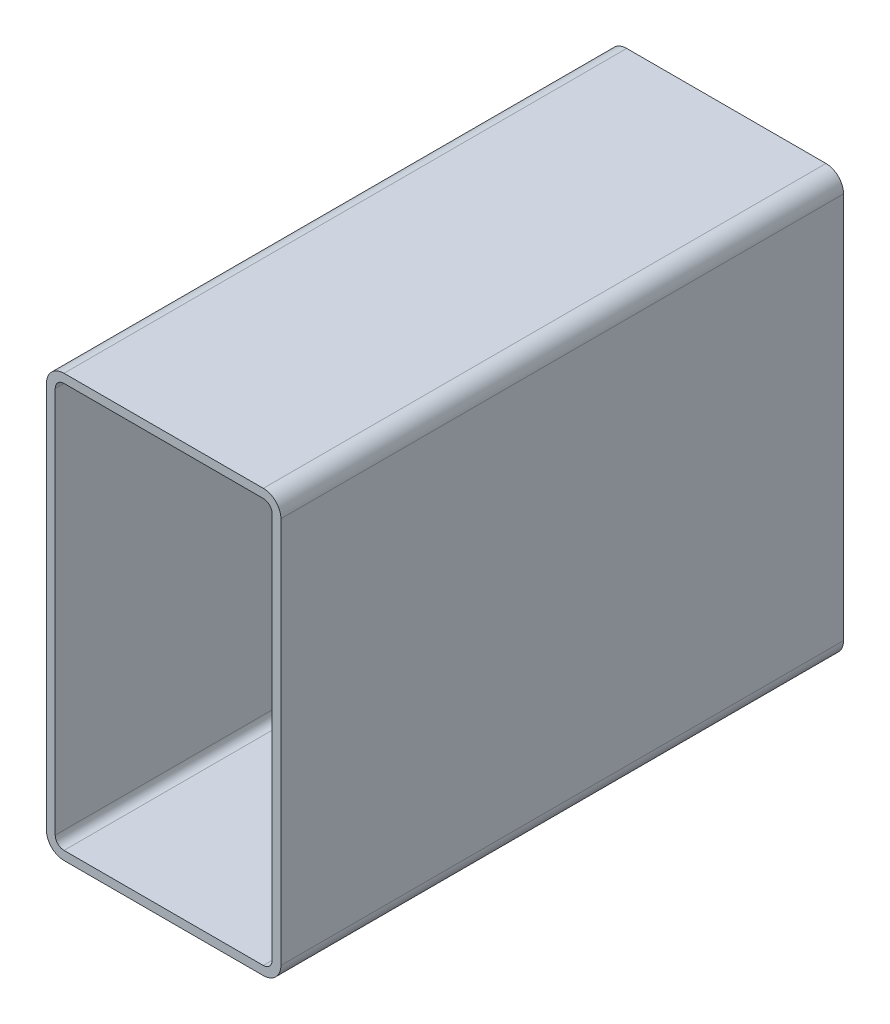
ISO-10303-21;
HEADER;
FILE_DESCRIPTION(('STEP AP214'),'2;1');
FILE_NAME('part.step','',(''),(''),'','','');
FILE_SCHEMA(('AUTOMOTIVE_DESIGN { 1 0 10303 214 1 1 1 1 }'));
ENDSEC;
DATA;
#1=APPLICATION_CONTEXT('core data for automotive mechanical design processes');
#2=APPLICATION_PROTOCOL_DEFINITION('international standard','automotive_design',2000,#1);
#3=PRODUCT_CONTEXT('',#1,'mechanical');
#4=PRODUCT('Part','Part','',(#3));
#5=PRODUCT_RELATED_PRODUCT_CATEGORY('part','',(#4));
#6=PRODUCT_DEFINITION_FORMATION('','',#4);
#7=PRODUCT_DEFINITION_CONTEXT('part definition',#1,'design');
#8=PRODUCT_DEFINITION('design','',#6,#7);
#9=PRODUCT_DEFINITION_SHAPE('','',#8);
#10=(LENGTH_UNIT() NAMED_UNIT(*) SI_UNIT(.MILLI.,.METRE.));
#11=(NAMED_UNIT(*) PLANE_ANGLE_UNIT() SI_UNIT($,.RADIAN.));
#12=(NAMED_UNIT(*) SI_UNIT($,.STERADIAN.) SOLID_ANGLE_UNIT());
#13=UNCERTAINTY_MEASURE_WITH_UNIT(LENGTH_MEASURE(1.E-05),#10,'distance_accuracy_value','');
#14=(GEOMETRIC_REPRESENTATION_CONTEXT(3) GLOBAL_UNCERTAINTY_ASSIGNED_CONTEXT((#13)) GLOBAL_UNIT_ASSIGNED_CONTEXT((#10,
#11,#12)) REPRESENTATION_CONTEXT('',''));
#15=CARTESIAN_POINT('',(0.,0.,0.));
#16=DIRECTION('',(0.,0.,1.));
#17=DIRECTION('',(1.,0.,0.));
#18=AXIS2_PLACEMENT_3D('',#15,#16,#17);
#19=CARTESIAN_POINT('',(10.3862396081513,221.018222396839,304.8));
#20=DIRECTION('',(0.,0.,1.));
#21=DIRECTION('',(1.,0.,0.));
#22=AXIS2_PLACEMENT_3D('',#19,#20,#21);
#23=PLANE('',#22);
#24=CARTESIAN_POINT('',(10.3862396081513,221.018222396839,304.8));
#25=DIRECTION('',(0.,0.,1.));
#26=DIRECTION('',(1.,0.,0.));
#27=AXIS2_PLACEMENT_3D('',#24,#25,#26);
#28=CIRCLE('',#27,9.52500000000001);
#29=CARTESIAN_POINT('',(10.3862396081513,230.543222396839,304.8));
#30=VERTEX_POINT('',#29);
#31=CARTESIAN_POINT('',(0.8612396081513,221.018222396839,304.8));
#32=VERTEX_POINT('',#31);
#33=EDGE_CURVE('E211',#30,#32,#28,.T.);
#34=ORIENTED_EDGE('',*,*,#33,.T.);
#35=DIRECTION('',(0.,-1.,0.));
#36=VECTOR('',#35,1.);
#37=CARTESIAN_POINT('',(0.8612396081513,11.4682223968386,304.8));
#38=LINE('',#37,#36);
#39=CARTESIAN_POINT('',(0.8612396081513,11.4682223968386,304.8));
#40=VERTEX_POINT('',#39);
#41=EDGE_CURVE('E214',#32,#40,#38,.T.);
#42=ORIENTED_EDGE('',*,*,#41,.T.);
#43=CARTESIAN_POINT('',(10.3862396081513,11.4682223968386,304.8));
#44=DIRECTION('',(0.,0.,1.));
#45=DIRECTION('',(1.,0.,0.));
#46=AXIS2_PLACEMENT_3D('',#43,#44,#45);
#47=CIRCLE('',#46,9.525);
#48=CARTESIAN_POINT('',(10.3862396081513,1.94322239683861,304.8));
#49=VERTEX_POINT('',#48);
#50=EDGE_CURVE('E217',#40,#49,#47,.T.);
#51=ORIENTED_EDGE('',*,*,#50,.T.);
#52=DIRECTION('',(1.,0.,0.));
#53=VECTOR('',#52,1.);
#54=CARTESIAN_POINT('',(118.336239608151,1.94322239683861,304.8));
#55=LINE('',#54,#53);
#56=CARTESIAN_POINT('',(118.336239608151,1.94322239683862,304.8));
#57=VERTEX_POINT('',#56);
#58=EDGE_CURVE('E219',#49,#57,#55,.T.);
#59=ORIENTED_EDGE('',*,*,#58,.T.);
#60=CARTESIAN_POINT('',(118.336239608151,11.4682223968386,304.8));
#61=DIRECTION('',(0.,0.,1.));
#62=DIRECTION('',(1.,0.,0.));
#63=AXIS2_PLACEMENT_3D('',#60,#61,#62);
#64=CIRCLE('',#63,9.525);
#65=CARTESIAN_POINT('',(127.861239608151,11.4682223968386,304.8));
#66=VERTEX_POINT('',#65);
#67=EDGE_CURVE('E221',#57,#66,#64,.T.);
#68=ORIENTED_EDGE('',*,*,#67,.T.);
#69=DIRECTION('',(0.,1.,0.));
#70=VECTOR('',#69,1.);
#71=CARTESIAN_POINT('',(127.861239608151,221.018222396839,304.8));
#72=LINE('',#71,#70);
#73=CARTESIAN_POINT('',(127.861239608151,221.018222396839,304.8));
#74=VERTEX_POINT('',#73);
#75=EDGE_CURVE('E223',#66,#74,#72,.T.);
#76=ORIENTED_EDGE('',*,*,#75,.T.);
#77=CARTESIAN_POINT('',(118.336239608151,221.018222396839,304.8));
#78=DIRECTION('',(0.,0.,1.));
#79=DIRECTION('',(1.,0.,0.));
#80=AXIS2_PLACEMENT_3D('',#77,#78,#79);
#81=CIRCLE('',#80,9.525);
#82=CARTESIAN_POINT('',(118.336239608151,230.543222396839,304.8));
#83=VERTEX_POINT('',#82);
#84=EDGE_CURVE('E225',#74,#83,#81,.T.);
#85=ORIENTED_EDGE('',*,*,#84,.T.);
#86=DIRECTION('',(-1.,0.,0.));
#87=VECTOR('',#86,1.);
#88=CARTESIAN_POINT('',(10.3862396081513,230.543222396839,304.8));
#89=LINE('',#88,#87);
#90=EDGE_CURVE('E227',#83,#30,#89,.T.);
#91=ORIENTED_EDGE('',*,*,#90,.T.);
#92=EDGE_LOOP('',(#34,#42,#51,#59,#68,#76,#85,#91));
#93=FACE_BOUND('',#92,.T.);
#94=DIRECTION('',(0.,-1.,0.));
#95=VECTOR('',#94,1.);
#96=CARTESIAN_POINT('',(5.6237396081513,11.4682223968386,304.8));
#97=LINE('',#96,#95);
#98=CARTESIAN_POINT('',(5.6237396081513,221.018222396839,304.8));
#99=VERTEX_POINT('',#98);
#100=CARTESIAN_POINT('',(5.6237396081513,11.4682223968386,304.8));
#101=VERTEX_POINT('',#100);
#102=EDGE_CURVE('E154',#99,#101,#97,.T.);
#103=ORIENTED_EDGE('',*,*,#102,.F.);
#104=CARTESIAN_POINT('',(10.3862396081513,221.018222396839,304.8));
#105=DIRECTION('',(0.,0.,1.));
#106=DIRECTION('',(1.,0.,0.));
#107=AXIS2_PLACEMENT_3D('',#104,#105,#106);
#108=CIRCLE('',#107,4.7625);
#109=CARTESIAN_POINT('',(10.3862396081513,225.780722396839,304.8));
#110=VERTEX_POINT('',#109);
#111=EDGE_CURVE('E146',#110,#99,#108,.T.);
#112=ORIENTED_EDGE('',*,*,#111,.F.);
#113=DIRECTION('',(-1.,0.,0.));
#114=VECTOR('',#113,1.);
#115=CARTESIAN_POINT('',(10.3862396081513,225.780722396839,304.8));
#116=LINE('',#115,#114);
#117=CARTESIAN_POINT('',(118.336239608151,225.780722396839,304.8));
#118=VERTEX_POINT('',#117);
#119=EDGE_CURVE('E179',#118,#110,#116,.T.);
#120=ORIENTED_EDGE('',*,*,#119,.F.);
#121=CARTESIAN_POINT('',(118.336239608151,221.018222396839,304.8));
#122=DIRECTION('',(0.,0.,1.));
#123=DIRECTION('',(1.,0.,0.));
#124=AXIS2_PLACEMENT_3D('',#121,#122,#123);
#125=CIRCLE('',#124,4.7625);
#126=CARTESIAN_POINT('',(123.098739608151,221.018222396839,304.8));
#127=VERTEX_POINT('',#126);
#128=EDGE_CURVE('E177',#127,#118,#125,.T.);
#129=ORIENTED_EDGE('',*,*,#128,.F.);
#130=DIRECTION('',(0.,1.,0.));
#131=VECTOR('',#130,1.);
#132=CARTESIAN_POINT('',(123.098739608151,221.018222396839,304.8));
#133=LINE('',#132,#131);
#134=CARTESIAN_POINT('',(123.098739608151,11.4682223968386,304.8));
#135=VERTEX_POINT('',#134);
#136=EDGE_CURVE('E175',#135,#127,#133,.T.);
#137=ORIENTED_EDGE('',*,*,#136,.F.);
#138=CARTESIAN_POINT('',(118.336239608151,11.4682223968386,304.8));
#139=DIRECTION('',(0.,0.,1.));
#140=DIRECTION('',(1.,0.,0.));
#141=AXIS2_PLACEMENT_3D('',#138,#139,#140);
#142=CIRCLE('',#141,4.7625);
#143=CARTESIAN_POINT('',(118.336239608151,6.70572239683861,304.8));
#144=VERTEX_POINT('',#143);
#145=EDGE_CURVE('E173',#144,#135,#142,.T.);
#146=ORIENTED_EDGE('',*,*,#145,.F.);
#147=DIRECTION('',(1.,0.,0.));
#148=VECTOR('',#147,1.);
#149=CARTESIAN_POINT('',(118.336239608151,6.70572239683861,304.8));
#150=LINE('',#149,#148);
#151=CARTESIAN_POINT('',(10.3862396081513,6.70572239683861,304.8));
#152=VERTEX_POINT('',#151);
#153=EDGE_CURVE('E169',#152,#144,#150,.T.);
#154=ORIENTED_EDGE('',*,*,#153,.F.);
#155=CARTESIAN_POINT('',(10.3862396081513,11.4682223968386,304.8));
#156=DIRECTION('',(0.,0.,1.));
#157=DIRECTION('',(1.,0.,0.));
#158=AXIS2_PLACEMENT_3D('',#155,#156,#157);
#159=CIRCLE('',#158,4.7625);
#160=EDGE_CURVE('E167',#101,#152,#159,.T.);
#161=ORIENTED_EDGE('',*,*,#160,.F.);
#162=EDGE_LOOP('',(#103,#112,#120,#129,#137,#146,#154,#161));
#163=FACE_BOUND('',#162,.T.);
#164=ADVANCED_FACE('F33',(#93,#163),#23,.T.);
#165=CARTESIAN_POINT('',(10.3862396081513,221.018222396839,0.));
#166=DIRECTION('',(0.,0.,1.));
#167=DIRECTION('',(1.,0.,0.));
#168=AXIS2_PLACEMENT_3D('',#165,#166,#167);
#169=PLANE('',#168);
#170=CARTESIAN_POINT('',(10.3862396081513,221.018222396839,0.));
#171=DIRECTION('',(0.,0.,1.));
#172=DIRECTION('',(1.,0.,0.));
#173=AXIS2_PLACEMENT_3D('',#170,#171,#172);
#174=CIRCLE('',#173,9.52500000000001);
#175=CARTESIAN_POINT('',(10.3862396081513,230.543222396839,0.));
#176=VERTEX_POINT('',#175);
#177=CARTESIAN_POINT('',(0.8612396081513,221.018222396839,0.));
#178=VERTEX_POINT('',#177);
#179=EDGE_CURVE('E162',#176,#178,#174,.T.);
#180=ORIENTED_EDGE('',*,*,#179,.F.);
#181=DIRECTION('',(-1.,0.,0.));
#182=VECTOR('',#181,1.);
#183=CARTESIAN_POINT('',(10.3862396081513,230.543222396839,0.));
#184=LINE('',#183,#182);
#185=CARTESIAN_POINT('',(118.336239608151,230.543222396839,0.));
#186=VERTEX_POINT('',#185);
#187=EDGE_CURVE('E215',#186,#176,#184,.T.);
#188=ORIENTED_EDGE('',*,*,#187,.F.);
#189=CARTESIAN_POINT('',(118.336239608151,221.018222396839,0.));
#190=DIRECTION('',(0.,0.,1.));
#191=DIRECTION('',(1.,0.,0.));
#192=AXIS2_PLACEMENT_3D('',#189,#190,#191);
#193=CIRCLE('',#192,9.525);
#194=CARTESIAN_POINT('',(127.861239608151,221.018222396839,0.));
#195=VERTEX_POINT('',#194);
#196=EDGE_CURVE('E242',#195,#186,#193,.T.);
#197=ORIENTED_EDGE('',*,*,#196,.F.);
#198=DIRECTION('',(0.,1.,0.));
#199=VECTOR('',#198,1.);
#200=CARTESIAN_POINT('',(127.861239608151,221.018222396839,0.));
#201=LINE('',#200,#199);
#202=CARTESIAN_POINT('',(127.861239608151,11.4682223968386,0.));
#203=VERTEX_POINT('',#202);
#204=EDGE_CURVE('E240',#203,#195,#201,.T.);
#205=ORIENTED_EDGE('',*,*,#204,.F.);
#206=CARTESIAN_POINT('',(118.336239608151,11.4682223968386,0.));
#207=DIRECTION('',(0.,0.,1.));
#208=DIRECTION('',(1.,0.,0.));
#209=AXIS2_PLACEMENT_3D('',#206,#207,#208);
#210=CIRCLE('',#209,9.525);
#211=CARTESIAN_POINT('',(118.336239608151,1.94322239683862,0.));
#212=VERTEX_POINT('',#211);
#213=EDGE_CURVE('E238',#212,#203,#210,.T.);
#214=ORIENTED_EDGE('',*,*,#213,.F.);
#215=DIRECTION('',(1.,0.,0.));
#216=VECTOR('',#215,1.);
#217=CARTESIAN_POINT('',(118.336239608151,1.94322239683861,0.));
#218=LINE('',#217,#216);
#219=CARTESIAN_POINT('',(10.3862396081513,1.94322239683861,0.));
#220=VERTEX_POINT('',#219);
#221=EDGE_CURVE('E236',#220,#212,#218,.T.);
#222=ORIENTED_EDGE('',*,*,#221,.F.);
#223=CARTESIAN_POINT('',(10.3862396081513,11.4682223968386,0.));
#224=DIRECTION('',(0.,0.,1.));
#225=DIRECTION('',(1.,0.,0.));
#226=AXIS2_PLACEMENT_3D('',#223,#224,#225);
#227=CIRCLE('',#226,9.525);
#228=CARTESIAN_POINT('',(0.8612396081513,11.4682223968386,0.));
#229=VERTEX_POINT('',#228);
#230=EDGE_CURVE('E234',#229,#220,#227,.T.);
#231=ORIENTED_EDGE('',*,*,#230,.F.);
#232=DIRECTION('',(0.,-1.,0.));
#233=VECTOR('',#232,1.);
#234=CARTESIAN_POINT('',(0.8612396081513,11.4682223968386,0.));
#235=LINE('',#234,#233);
#236=EDGE_CURVE('E232',#178,#229,#235,.T.);
#237=ORIENTED_EDGE('',*,*,#236,.F.);
#238=EDGE_LOOP('',(#180,#188,#197,#205,#214,#222,#231,#237));
#239=FACE_BOUND('',#238,.T.);
#240=CARTESIAN_POINT('',(10.3862396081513,221.018222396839,0.));
#241=DIRECTION('',(0.,0.,1.));
#242=DIRECTION('',(1.,0.,0.));
#243=AXIS2_PLACEMENT_3D('',#240,#241,#242);
#244=CIRCLE('',#243,4.7625);
#245=CARTESIAN_POINT('',(10.3862396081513,225.780722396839,0.));
#246=VERTEX_POINT('',#245);
#247=CARTESIAN_POINT('',(5.6237396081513,221.018222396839,0.));
#248=VERTEX_POINT('',#247);
#249=EDGE_CURVE('E56',#246,#248,#244,.T.);
#250=ORIENTED_EDGE('',*,*,#249,.T.);
#251=DIRECTION('',(0.,-1.,0.));
#252=VECTOR('',#251,1.);
#253=CARTESIAN_POINT('',(5.6237396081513,11.4682223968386,0.));
#254=LINE('',#253,#252);
#255=CARTESIAN_POINT('',(5.6237396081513,11.4682223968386,0.));
#256=VERTEX_POINT('',#255);
#257=EDGE_CURVE('E161',#248,#256,#254,.T.);
#258=ORIENTED_EDGE('',*,*,#257,.T.);
#259=CARTESIAN_POINT('',(10.3862396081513,11.4682223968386,0.));
#260=DIRECTION('',(0.,0.,1.));
#261=DIRECTION('',(1.,0.,0.));
#262=AXIS2_PLACEMENT_3D('',#259,#260,#261);
#263=CIRCLE('',#262,4.7625);
#264=CARTESIAN_POINT('',(10.3862396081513,6.70572239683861,0.));
#265=VERTEX_POINT('',#264);
#266=EDGE_CURVE('E183',#256,#265,#263,.T.);
#267=ORIENTED_EDGE('',*,*,#266,.T.);
#268=DIRECTION('',(1.,0.,0.));
#269=VECTOR('',#268,1.);
#270=CARTESIAN_POINT('',(118.336239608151,6.70572239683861,0.));
#271=LINE('',#270,#269);
#272=CARTESIAN_POINT('',(118.336239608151,6.70572239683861,0.));
#273=VERTEX_POINT('',#272);
#274=EDGE_CURVE('E186',#265,#273,#271,.T.);
#275=ORIENTED_EDGE('',*,*,#274,.T.);
#276=CARTESIAN_POINT('',(118.336239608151,11.4682223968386,0.));
#277=DIRECTION('',(0.,0.,1.));
#278=DIRECTION('',(1.,0.,0.));
#279=AXIS2_PLACEMENT_3D('',#276,#277,#278);
#280=CIRCLE('',#279,4.7625);
#281=CARTESIAN_POINT('',(123.098739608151,11.4682223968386,0.));
#282=VERTEX_POINT('',#281);
#283=EDGE_CURVE('E189',#273,#282,#280,.T.);
#284=ORIENTED_EDGE('',*,*,#283,.T.);
#285=DIRECTION('',(0.,1.,0.));
#286=VECTOR('',#285,1.);
#287=CARTESIAN_POINT('',(123.098739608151,221.018222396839,0.));
#288=LINE('',#287,#286);
#289=CARTESIAN_POINT('',(123.098739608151,221.018222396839,0.));
#290=VERTEX_POINT('',#289);
#291=EDGE_CURVE('E192',#282,#290,#288,.T.);
#292=ORIENTED_EDGE('',*,*,#291,.T.);
#293=CARTESIAN_POINT('',(118.336239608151,221.018222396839,0.));
#294=DIRECTION('',(0.,0.,1.));
#295=DIRECTION('',(1.,0.,0.));
#296=AXIS2_PLACEMENT_3D('',#293,#294,#295);
#297=CIRCLE('',#296,4.7625);
#298=CARTESIAN_POINT('',(118.336239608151,225.780722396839,0.));
#299=VERTEX_POINT('',#298);
#300=EDGE_CURVE('E195',#290,#299,#297,.T.);
#301=ORIENTED_EDGE('',*,*,#300,.T.);
#302=DIRECTION('',(-1.,0.,0.));
#303=VECTOR('',#302,1.);
#304=CARTESIAN_POINT('',(10.3862396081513,225.780722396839,0.));
#305=LINE('',#304,#303);
#306=EDGE_CURVE('E155',#299,#246,#305,.T.);
#307=ORIENTED_EDGE('',*,*,#306,.T.);
#308=EDGE_LOOP('',(#250,#258,#267,#275,#284,#292,#301,#307));
#309=FACE_BOUND('',#308,.T.);
#310=ADVANCED_FACE('F272',(#239,#309),#169,.F.);
#311=CARTESIAN_POINT('',(10.3862396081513,221.018222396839,304.8));
#312=DIRECTION('',(0.,0.,-1.));
#313=DIRECTION('',(-1.,0.,0.));
#314=AXIS2_PLACEMENT_3D('',#311,#312,#313);
#315=CYLINDRICAL_SURFACE('',#314,9.52500000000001);
#316=ORIENTED_EDGE('',*,*,#179,.T.);
#317=DIRECTION('',(0.,0.,-1.));
#318=VECTOR('',#317,1.);
#319=CARTESIAN_POINT('',(0.8612396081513,221.018222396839,304.8));
#320=LINE('',#319,#318);
#321=EDGE_CURVE('E11',#32,#178,#320,.T.);
#322=ORIENTED_EDGE('',*,*,#321,.F.);
#323=ORIENTED_EDGE('',*,*,#33,.F.);
#324=DIRECTION('',(0.,0.,-1.));
#325=VECTOR('',#324,1.);
#326=CARTESIAN_POINT('',(10.3862396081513,230.543222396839,304.8));
#327=LINE('',#326,#325);
#328=EDGE_CURVE('E229',#30,#176,#327,.T.);
#329=ORIENTED_EDGE('',*,*,#328,.T.);
#330=EDGE_LOOP('',(#316,#322,#323,#329));
#331=FACE_BOUND('',#330,.T.);
#332=ADVANCED_FACE('F35',(#331),#315,.T.);
#333=CARTESIAN_POINT('',(0.8612396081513,11.4682223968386,304.8));
#334=DIRECTION('',(1.,0.,0.));
#335=DIRECTION('',(0.,0.,-1.));
#336=AXIS2_PLACEMENT_3D('',#333,#334,#335);
#337=PLANE('',#336);
#338=ORIENTED_EDGE('',*,*,#236,.T.);
#339=DIRECTION('',(0.,0.,-1.));
#340=VECTOR('',#339,1.);
#341=CARTESIAN_POINT('',(0.8612396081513,11.4682223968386,304.8));
#342=LINE('',#341,#340);
#343=EDGE_CURVE('E41',#40,#229,#342,.T.);
#344=ORIENTED_EDGE('',*,*,#343,.F.);
#345=ORIENTED_EDGE('',*,*,#41,.F.);
#346=ORIENTED_EDGE('',*,*,#321,.T.);
#347=EDGE_LOOP('',(#338,#344,#345,#346));
#348=FACE_BOUND('',#347,.T.);
#349=ADVANCED_FACE('F289',(#348),#337,.F.);
#350=CARTESIAN_POINT('',(10.3862396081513,11.4682223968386,304.8));
#351=DIRECTION('',(0.,0.,-1.));
#352=DIRECTION('',(-1.,0.,0.));
#353=AXIS2_PLACEMENT_3D('',#350,#351,#352);
#354=CYLINDRICAL_SURFACE('',#353,9.525);
#355=ORIENTED_EDGE('',*,*,#230,.T.);
#356=DIRECTION('',(0.,0.,-1.));
#357=VECTOR('',#356,1.);
#358=CARTESIAN_POINT('',(10.3862396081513,1.94322239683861,304.8));
#359=LINE('',#358,#357);
#360=EDGE_CURVE('E259',#49,#220,#359,.T.);
#361=ORIENTED_EDGE('',*,*,#360,.F.);
#362=ORIENTED_EDGE('',*,*,#50,.F.);
#363=ORIENTED_EDGE('',*,*,#343,.T.);
#364=EDGE_LOOP('',(#355,#361,#362,#363));
#365=FACE_BOUND('',#364,.T.);
#366=ADVANCED_FACE('F266',(#365),#354,.T.);
#367=CARTESIAN_POINT('',(118.336239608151,1.94322239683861,304.8));
#368=DIRECTION('',(0.,1.,0.));
#369=DIRECTION('',(0.,0.,1.));
#370=AXIS2_PLACEMENT_3D('',#367,#368,#369);
#371=PLANE('',#370);
#372=ORIENTED_EDGE('',*,*,#221,.T.);
#373=DIRECTION('',(0.,0.,-1.));
#374=VECTOR('',#373,1.);
#375=CARTESIAN_POINT('',(118.336239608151,1.94322239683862,304.8));
#376=LINE('',#375,#374);
#377=EDGE_CURVE('E256',#57,#212,#376,.T.);
#378=ORIENTED_EDGE('',*,*,#377,.F.);
#379=ORIENTED_EDGE('',*,*,#58,.F.);
#380=ORIENTED_EDGE('',*,*,#360,.T.);
#381=EDGE_LOOP('',(#372,#378,#379,#380));
#382=FACE_BOUND('',#381,.T.);
#383=ADVANCED_FACE('F278',(#382),#371,.F.);
#384=CARTESIAN_POINT('',(118.336239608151,11.4682223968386,304.8));
#385=DIRECTION('',(0.,0.,-1.));
#386=DIRECTION('',(-1.,0.,0.));
#387=AXIS2_PLACEMENT_3D('',#384,#385,#386);
#388=CYLINDRICAL_SURFACE('',#387,9.525);
#389=ORIENTED_EDGE('',*,*,#213,.T.);
#390=DIRECTION('',(0.,0.,-1.));
#391=VECTOR('',#390,1.);
#392=CARTESIAN_POINT('',(127.861239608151,11.4682223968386,304.8));
#393=LINE('',#392,#391);
#394=EDGE_CURVE('E253',#66,#203,#393,.T.);
#395=ORIENTED_EDGE('',*,*,#394,.F.);
#396=ORIENTED_EDGE('',*,*,#67,.F.);
#397=ORIENTED_EDGE('',*,*,#377,.T.);
#398=EDGE_LOOP('',(#389,#395,#396,#397));
#399=FACE_BOUND('',#398,.T.);
#400=ADVANCED_FACE('F282',(#399),#388,.T.);
#401=CARTESIAN_POINT('',(127.861239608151,221.018222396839,304.8));
#402=DIRECTION('',(-1.,0.,0.));
#403=DIRECTION('',(0.,0.,1.));
#404=AXIS2_PLACEMENT_3D('',#401,#402,#403);
#405=PLANE('',#404);
#406=ORIENTED_EDGE('',*,*,#204,.T.);
#407=DIRECTION('',(0.,0.,-1.));
#408=VECTOR('',#407,1.);
#409=CARTESIAN_POINT('',(127.861239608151,221.018222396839,304.8));
#410=LINE('',#409,#408);
#411=EDGE_CURVE('E250',#74,#195,#410,.T.);
#412=ORIENTED_EDGE('',*,*,#411,.F.);
#413=ORIENTED_EDGE('',*,*,#75,.F.);
#414=ORIENTED_EDGE('',*,*,#394,.T.);
#415=EDGE_LOOP('',(#406,#412,#413,#414));
#416=FACE_BOUND('',#415,.T.);
#417=ADVANCED_FACE('F302',(#416),#405,.F.);
#418=CARTESIAN_POINT('',(118.336239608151,221.018222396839,304.8));
#419=DIRECTION('',(0.,0.,-1.));
#420=DIRECTION('',(-1.,0.,0.));
#421=AXIS2_PLACEMENT_3D('',#418,#419,#420);
#422=CYLINDRICAL_SURFACE('',#421,9.525);
#423=ORIENTED_EDGE('',*,*,#196,.T.);
#424=DIRECTION('',(0.,0.,-1.));
#425=VECTOR('',#424,1.);
#426=CARTESIAN_POINT('',(118.336239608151,230.543222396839,304.8));
#427=LINE('',#426,#425);
#428=EDGE_CURVE('E247',#83,#186,#427,.T.);
#429=ORIENTED_EDGE('',*,*,#428,.F.);
#430=ORIENTED_EDGE('',*,*,#84,.F.);
#431=ORIENTED_EDGE('',*,*,#411,.T.);
#432=EDGE_LOOP('',(#423,#429,#430,#431));
#433=FACE_BOUND('',#432,.T.);
#434=ADVANCED_FACE('F300',(#433),#422,.T.);
#435=CARTESIAN_POINT('',(10.3862396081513,230.543222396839,304.8));
#436=DIRECTION('',(0.,-1.,0.));
#437=DIRECTION('',(0.,0.,-1.));
#438=AXIS2_PLACEMENT_3D('',#435,#436,#437);
#439=PLANE('',#438);
#440=ORIENTED_EDGE('',*,*,#187,.T.);
#441=ORIENTED_EDGE('',*,*,#328,.F.);
#442=ORIENTED_EDGE('',*,*,#90,.F.);
#443=ORIENTED_EDGE('',*,*,#428,.T.);
#444=EDGE_LOOP('',(#440,#441,#442,#443));
#445=FACE_BOUND('',#444,.T.);
#446=ADVANCED_FACE('F295',(#445),#439,.F.);
#447=CARTESIAN_POINT('',(10.3862396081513,221.018222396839,304.8));
#448=DIRECTION('',(0.,0.,-1.));
#449=DIRECTION('',(-1.,0.,0.));
#450=AXIS2_PLACEMENT_3D('',#447,#448,#449);
#451=CYLINDRICAL_SURFACE('',#450,4.7625);
#452=ORIENTED_EDGE('',*,*,#249,.F.);
#453=DIRECTION('',(0.,0.,-1.));
#454=VECTOR('',#453,1.);
#455=CARTESIAN_POINT('',(10.3862396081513,225.780722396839,304.8));
#456=LINE('',#455,#454);
#457=EDGE_CURVE('E150',#110,#246,#456,.T.);
#458=ORIENTED_EDGE('',*,*,#457,.F.);
#459=ORIENTED_EDGE('',*,*,#111,.T.);
#460=DIRECTION('',(0.,0.,-1.));
#461=VECTOR('',#460,1.);
#462=CARTESIAN_POINT('',(5.6237396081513,221.018222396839,304.8));
#463=LINE('',#462,#461);
#464=EDGE_CURVE('E149',#99,#248,#463,.T.);
#465=ORIENTED_EDGE('',*,*,#464,.T.);
#466=EDGE_LOOP('',(#452,#458,#459,#465));
#467=FACE_BOUND('',#466,.T.);
#468=ADVANCED_FACE('F148',(#467),#451,.F.);
#469=CARTESIAN_POINT('',(5.6237396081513,11.4682223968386,304.8));
#470=DIRECTION('',(1.,0.,0.));
#471=DIRECTION('',(0.,0.,-1.));
#472=AXIS2_PLACEMENT_3D('',#469,#470,#471);
#473=PLANE('',#472);
#474=ORIENTED_EDGE('',*,*,#257,.F.);
#475=ORIENTED_EDGE('',*,*,#464,.F.);
#476=ORIENTED_EDGE('',*,*,#102,.T.);
#477=DIRECTION('',(0.,0.,-1.));
#478=VECTOR('',#477,1.);
#479=CARTESIAN_POINT('',(5.6237396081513,11.4682223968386,304.8));
#480=LINE('',#479,#478);
#481=EDGE_CURVE('E163',#101,#256,#480,.T.);
#482=ORIENTED_EDGE('',*,*,#481,.T.);
#483=EDGE_LOOP('',(#474,#475,#476,#482));
#484=FACE_BOUND('',#483,.T.);
#485=ADVANCED_FACE('F158',(#484),#473,.T.);
#486=CARTESIAN_POINT('',(10.3862396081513,11.4682223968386,304.8));
#487=DIRECTION('',(0.,0.,-1.));
#488=DIRECTION('',(-1.,0.,0.));
#489=AXIS2_PLACEMENT_3D('',#486,#487,#488);
#490=CYLINDRICAL_SURFACE('',#489,4.7625);
#491=ORIENTED_EDGE('',*,*,#266,.F.);
#492=ORIENTED_EDGE('',*,*,#481,.F.);
#493=ORIENTED_EDGE('',*,*,#160,.T.);
#494=DIRECTION('',(0.,0.,-1.));
#495=VECTOR('',#494,1.);
#496=CARTESIAN_POINT('',(10.3862396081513,6.70572239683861,304.8));
#497=LINE('',#496,#495);
#498=EDGE_CURVE('E208',#152,#265,#497,.T.);
#499=ORIENTED_EDGE('',*,*,#498,.T.);
#500=EDGE_LOOP('',(#491,#492,#493,#499));
#501=FACE_BOUND('',#500,.T.);
#502=ADVANCED_FACE('F327',(#501),#490,.F.);
#503=CARTESIAN_POINT('',(118.336239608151,6.70572239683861,304.8));
#504=DIRECTION('',(0.,1.,0.));
#505=DIRECTION('',(0.,0.,1.));
#506=AXIS2_PLACEMENT_3D('',#503,#504,#505);
#507=PLANE('',#506);
#508=ORIENTED_EDGE('',*,*,#274,.F.);
#509=ORIENTED_EDGE('',*,*,#498,.F.);
#510=ORIENTED_EDGE('',*,*,#153,.T.);
#511=DIRECTION('',(0.,0.,-1.));
#512=VECTOR('',#511,1.);
#513=CARTESIAN_POINT('',(118.336239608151,6.70572239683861,304.8));
#514=LINE('',#513,#512);
#515=EDGE_CURVE('E206',#144,#273,#514,.T.);
#516=ORIENTED_EDGE('',*,*,#515,.T.);
#517=EDGE_LOOP('',(#508,#509,#510,#516));
#518=FACE_BOUND('',#517,.T.);
#519=ADVANCED_FACE('F331',(#518),#507,.T.);
#520=CARTESIAN_POINT('',(118.336239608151,11.4682223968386,304.8));
#521=DIRECTION('',(0.,0.,-1.));
#522=DIRECTION('',(-1.,0.,0.));
#523=AXIS2_PLACEMENT_3D('',#520,#521,#522);
#524=CYLINDRICAL_SURFACE('',#523,4.7625);
#525=ORIENTED_EDGE('',*,*,#283,.F.);
#526=ORIENTED_EDGE('',*,*,#515,.F.);
#527=ORIENTED_EDGE('',*,*,#145,.T.);
#528=DIRECTION('',(0.,0.,-1.));
#529=VECTOR('',#528,1.);
#530=CARTESIAN_POINT('',(123.098739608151,11.4682223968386,304.8));
#531=LINE('',#530,#529);
#532=EDGE_CURVE('E204',#135,#282,#531,.T.);
#533=ORIENTED_EDGE('',*,*,#532,.T.);
#534=EDGE_LOOP('',(#525,#526,#527,#533));
#535=FACE_BOUND('',#534,.T.);
#536=ADVANCED_FACE('F337',(#535),#524,.F.);
#537=CARTESIAN_POINT('',(123.098739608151,221.018222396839,304.8));
#538=DIRECTION('',(-1.,0.,0.));
#539=DIRECTION('',(0.,0.,1.));
#540=AXIS2_PLACEMENT_3D('',#537,#538,#539);
#541=PLANE('',#540);
#542=ORIENTED_EDGE('',*,*,#291,.F.);
#543=ORIENTED_EDGE('',*,*,#532,.F.);
#544=ORIENTED_EDGE('',*,*,#136,.T.);
#545=DIRECTION('',(0.,0.,-1.));
#546=VECTOR('',#545,1.);
#547=CARTESIAN_POINT('',(123.098739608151,221.018222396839,304.8));
#548=LINE('',#547,#546);
#549=EDGE_CURVE('E202',#127,#290,#548,.T.);
#550=ORIENTED_EDGE('',*,*,#549,.T.);
#551=EDGE_LOOP('',(#542,#543,#544,#550));
#552=FACE_BOUND('',#551,.T.);
#553=ADVANCED_FACE('F341',(#552),#541,.T.);
#554=CARTESIAN_POINT('',(118.336239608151,221.018222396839,304.8));
#555=DIRECTION('',(0.,0.,-1.));
#556=DIRECTION('',(-1.,0.,0.));
#557=AXIS2_PLACEMENT_3D('',#554,#555,#556);
#558=CYLINDRICAL_SURFACE('',#557,4.7625);
#559=ORIENTED_EDGE('',*,*,#300,.F.);
#560=ORIENTED_EDGE('',*,*,#549,.F.);
#561=ORIENTED_EDGE('',*,*,#128,.T.);
#562=DIRECTION('',(0.,0.,-1.));
#563=VECTOR('',#562,1.);
#564=CARTESIAN_POINT('',(118.336239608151,225.780722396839,304.8));
#565=LINE('',#564,#563);
#566=EDGE_CURVE('E48',#118,#299,#565,.T.);
#567=ORIENTED_EDGE('',*,*,#566,.T.);
#568=EDGE_LOOP('',(#559,#560,#561,#567));
#569=FACE_BOUND('',#568,.T.);
#570=ADVANCED_FACE('F345',(#569),#558,.F.);
#571=CARTESIAN_POINT('',(10.3862396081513,225.780722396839,304.8));
#572=DIRECTION('',(0.,-1.,0.));
#573=DIRECTION('',(0.,0.,-1.));
#574=AXIS2_PLACEMENT_3D('',#571,#572,#573);
#575=PLANE('',#574);
#576=ORIENTED_EDGE('',*,*,#306,.F.);
#577=ORIENTED_EDGE('',*,*,#566,.F.);
#578=ORIENTED_EDGE('',*,*,#119,.T.);
#579=ORIENTED_EDGE('',*,*,#457,.T.);
#580=EDGE_LOOP('',(#576,#577,#578,#579));
#581=FACE_BOUND('',#580,.T.);
#582=ADVANCED_FACE('F349',(#581),#575,.T.);
#583=CLOSED_SHELL('',(#164,#310,#332,#349,#366,#383,#400,#417,#434,#446,#468,#485,#502,#519,
#536,#553,#570,#582));
#584=MANIFOLD_SOLID_BREP('B2',#583);
#585=ADVANCED_BREP_SHAPE_REPRESENTATION('',(#18,#584),#14);
#586=SHAPE_DEFINITION_REPRESENTATION(#9,#585);
ENDSEC;
END-ISO-10303-21;
